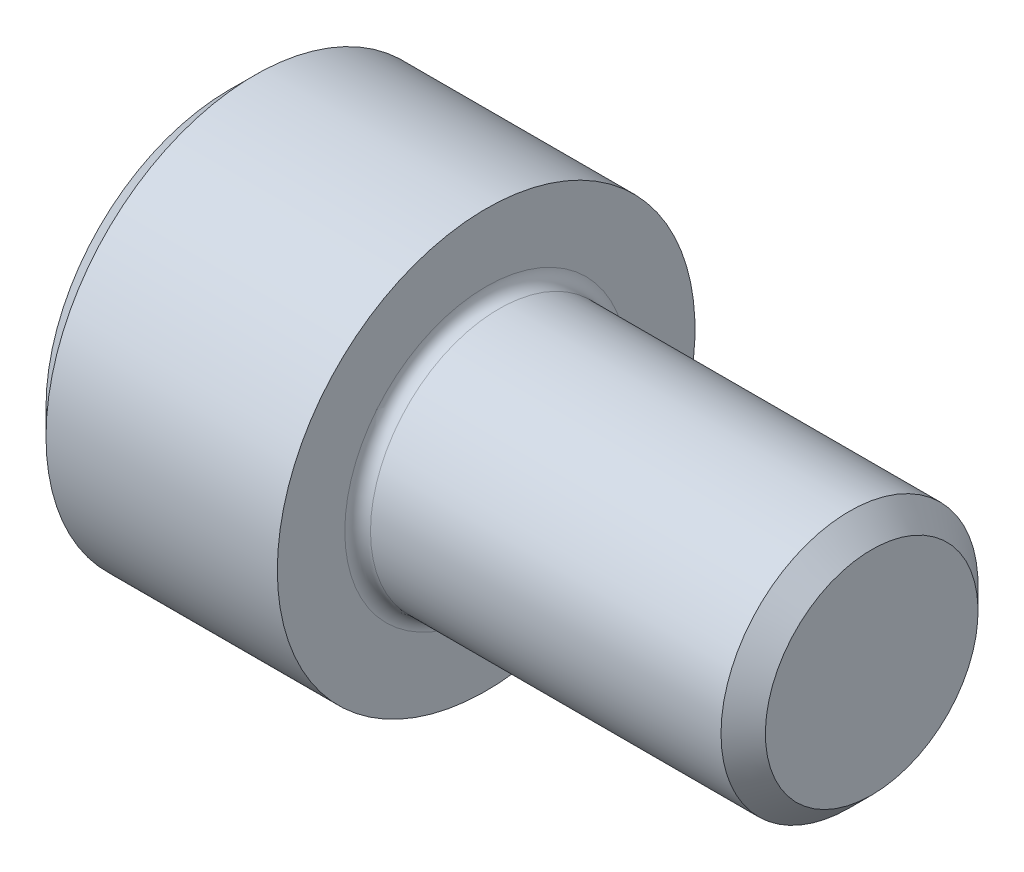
ISO-10303-21;
HEADER;
FILE_DESCRIPTION(('STEP AP214'),'2;1');
FILE_NAME('part.step','',(''),(''),'','','');
FILE_SCHEMA(('AUTOMOTIVE_DESIGN { 1 0 10303 214 1 1 1 1 }'));
ENDSEC;
DATA;
#1=APPLICATION_CONTEXT('core data for automotive mechanical design processes');
#2=APPLICATION_PROTOCOL_DEFINITION('international standard','automotive_design',2000,#1);
#3=PRODUCT_CONTEXT('',#1,'mechanical');
#4=PRODUCT('Part','Part','',(#3));
#5=PRODUCT_RELATED_PRODUCT_CATEGORY('part','',(#4));
#6=PRODUCT_DEFINITION_FORMATION('','',#4);
#7=PRODUCT_DEFINITION_CONTEXT('part definition',#1,'design');
#8=PRODUCT_DEFINITION('design','',#6,#7);
#9=PRODUCT_DEFINITION_SHAPE('','',#8);
#10=(LENGTH_UNIT() NAMED_UNIT(*) SI_UNIT(.MILLI.,.METRE.));
#11=(NAMED_UNIT(*) PLANE_ANGLE_UNIT() SI_UNIT($,.RADIAN.));
#12=(NAMED_UNIT(*) SI_UNIT($,.STERADIAN.) SOLID_ANGLE_UNIT());
#13=UNCERTAINTY_MEASURE_WITH_UNIT(LENGTH_MEASURE(1.E-05),#10,'distance_accuracy_value','');
#14=(GEOMETRIC_REPRESENTATION_CONTEXT(3) GLOBAL_UNCERTAINTY_ASSIGNED_CONTEXT((#13)) GLOBAL_UNIT_ASSIGNED_CONTEXT((#10,
#11,#12)) REPRESENTATION_CONTEXT('',''));
#15=CARTESIAN_POINT('',(0.,0.,0.));
#16=DIRECTION('',(0.,0.,1.));
#17=DIRECTION('',(1.,0.,0.));
#18=AXIS2_PLACEMENT_3D('',#15,#16,#17);
#19=CARTESIAN_POINT('',(20.,-3.349214,3.349214));
#20=DIRECTION('',(1.,0.,0.));
#21=DIRECTION('',(0.,0.,-1.));
#22=AXIS2_PLACEMENT_3D('',#19,#20,#21);
#23=PLANE('',#22);
#24=CARTESIAN_POINT('',(20.,0.,0.));
#25=DIRECTION('',(-1.,0.,0.));
#26=DIRECTION('',(0.,-1.,0.));
#27=AXIS2_PLACEMENT_3D('',#24,#25,#26);
#28=CIRCLE('',#27,3.30949999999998);
#29=CARTESIAN_POINT('',(20.,-3.30949999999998,0.));
#30=VERTEX_POINT('',#29);
#31=EDGE_CURVE('E20',#30,#30,#28,.F.);
#32=ORIENTED_EDGE('',*,*,#31,.T.);
#33=EDGE_LOOP('',(#32));
#34=FACE_BOUND('',#33,.T.);
#35=ADVANCED_FACE('F16',(#34),#23,.T.);
#36=CARTESIAN_POINT('',(20.,0.,0.));
#37=DIRECTION('',(-1.,0.,0.));
#38=DIRECTION('',(0.,-1.,0.));
#39=AXIS2_PLACEMENT_3D('',#36,#37,#38);
#40=CONICAL_SURFACE('',#39,3.3095,0.785398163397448);
#41=CARTESIAN_POINT('',(19.3095,0.,0.));
#42=DIRECTION('',(-1.,0.,0.));
#43=DIRECTION('',(0.,0.,1.));
#44=AXIS2_PLACEMENT_3D('',#41,#42,#43);
#45=CIRCLE('',#44,4.);
#46=CARTESIAN_POINT('',(19.3095,0.,4.));
#47=VERTEX_POINT('',#46);
#48=EDGE_CURVE('E124',#47,#47,#45,.F.);
#49=ORIENTED_EDGE('',*,*,#48,.T.);
#50=EDGE_LOOP('',(#49));
#51=FACE_BOUND('',#50,.T.);
#52=ORIENTED_EDGE('',*,*,#31,.F.);
#53=EDGE_LOOP('',(#52));
#54=FACE_BOUND('',#53,.T.);
#55=ADVANCED_FACE('F254',(#51,#54),#40,.T.);
#56=CARTESIAN_POINT('',(19.3095,0.,0.));
#57=DIRECTION('',(-1.,0.,0.));
#58=DIRECTION('',(0.,0.,1.));
#59=AXIS2_PLACEMENT_3D('',#56,#57,#58);
#60=CYLINDRICAL_SURFACE('',#59,4.);
#61=CARTESIAN_POINT('',(8.40000000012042,0.,0.));
#62=DIRECTION('',(1.,0.,0.));
#63=DIRECTION('',(0.,0.,-1.));
#64=AXIS2_PLACEMENT_3D('',#61,#62,#63);
#65=CIRCLE('',#64,4.00000000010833);
#66=CARTESIAN_POINT('',(8.40000000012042,0.,-4.00000000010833));
#67=VERTEX_POINT('',#66);
#68=EDGE_CURVE('E120',#67,#67,#65,.T.);
#69=ORIENTED_EDGE('',*,*,#68,.T.);
#70=EDGE_LOOP('',(#69));
#71=FACE_BOUND('',#70,.T.);
#72=ORIENTED_EDGE('',*,*,#48,.F.);
#73=EDGE_LOOP('',(#72));
#74=FACE_BOUND('',#73,.T.);
#75=ADVANCED_FACE('F250',(#71,#74),#60,.T.);
#76=CARTESIAN_POINT('',(8.40000000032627,0.,0.));
#77=DIRECTION('',(1.,0.,0.));
#78=DIRECTION('',(0.,0.,-1.));
#79=AXIS2_PLACEMENT_3D('',#76,#77,#78);
#80=TOROIDAL_SURFACE('',#79,4.40000000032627,0.400000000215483);
#81=ORIENTED_EDGE('',*,*,#68,.F.);
#82=EDGE_LOOP('',(#81));
#83=FACE_BOUND('',#82,.T.);
#84=CARTESIAN_POINT('',(8.00000000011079,0.,0.));
#85=DIRECTION('',(1.,0.,0.));
#86=DIRECTION('',(0.,0.,-1.));
#87=AXIS2_PLACEMENT_3D('',#84,#85,#86);
#88=CIRCLE('',#87,4.400000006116);
#89=CARTESIAN_POINT('',(8.00000000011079,0.,-4.400000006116));
#90=VERTEX_POINT('',#89);
#91=EDGE_CURVE('E118',#90,#90,#88,.F.);
#92=ORIENTED_EDGE('',*,*,#91,.F.);
#93=EDGE_LOOP('',(#92));
#94=FACE_BOUND('',#93,.T.);
#95=ADVANCED_FACE('F253',(#83,#94),#80,.F.);
#96=CARTESIAN_POINT('',(8.,-6.578,6.578));
#97=DIRECTION('',(1.,0.,0.));
#98=DIRECTION('',(0.,0.,-1.));
#99=AXIS2_PLACEMENT_3D('',#96,#97,#98);
#100=PLANE('',#99);
#101=ORIENTED_EDGE('',*,*,#91,.T.);
#102=EDGE_LOOP('',(#101));
#103=FACE_BOUND('',#102,.T.);
#104=CARTESIAN_POINT('',(8.,0.,0.));
#105=DIRECTION('',(-1.,0.,0.));
#106=DIRECTION('',(0.,0.,1.));
#107=AXIS2_PLACEMENT_3D('',#104,#105,#106);
#108=CIRCLE('',#107,6.5);
#109=CARTESIAN_POINT('',(8.,0.,6.5));
#110=VERTEX_POINT('',#109);
#111=EDGE_CURVE('E116',#110,#110,#108,.F.);
#112=ORIENTED_EDGE('',*,*,#111,.T.);
#113=EDGE_LOOP('',(#112));
#114=FACE_BOUND('',#113,.T.);
#115=ADVANCED_FACE('F248',(#103,#114),#100,.T.);
#116=CARTESIAN_POINT('',(8.,0.,0.));
#117=DIRECTION('',(-1.,0.,0.));
#118=DIRECTION('',(0.,0.,1.));
#119=AXIS2_PLACEMENT_3D('',#116,#117,#118);
#120=CYLINDRICAL_SURFACE('',#119,6.5);
#121=CARTESIAN_POINT('',(0.799999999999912,0.,0.));
#122=DIRECTION('',(1.,0.,0.));
#123=DIRECTION('',(0.,0.,-1.));
#124=AXIS2_PLACEMENT_3D('',#121,#122,#123);
#125=CIRCLE('',#124,6.5);
#126=CARTESIAN_POINT('',(0.8,0.,-6.5));
#127=VERTEX_POINT('',#126);
#128=EDGE_CURVE('E93',#127,#127,#125,.T.);
#129=ORIENTED_EDGE('',*,*,#128,.T.);
#130=EDGE_LOOP('',(#129));
#131=FACE_BOUND('',#130,.T.);
#132=ORIENTED_EDGE('',*,*,#111,.F.);
#133=EDGE_LOOP('',(#132));
#134=FACE_BOUND('',#133,.T.);
#135=ADVANCED_FACE('F244',(#131,#134),#120,.T.);
#136=CARTESIAN_POINT('',(0.,0.,0.));
#137=DIRECTION('',(1.,0.,0.));
#138=DIRECTION('',(0.,0.,-1.));
#139=AXIS2_PLACEMENT_3D('',#136,#137,#138);
#140=CONICAL_SURFACE('',#139,5.7,0.785398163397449);
#141=ORIENTED_EDGE('',*,*,#128,.F.);
#142=EDGE_LOOP('',(#141));
#143=FACE_BOUND('',#142,.T.);
#144=CARTESIAN_POINT('',(0.,0.,0.));
#145=DIRECTION('',(1.,0.,0.));
#146=DIRECTION('',(0.,0.,-1.));
#147=AXIS2_PLACEMENT_3D('',#144,#145,#146);
#148=CIRCLE('',#147,5.7);
#149=CARTESIAN_POINT('',(0.,0.,-5.7));
#150=VERTEX_POINT('',#149);
#151=EDGE_CURVE('E92',#150,#150,#148,.F.);
#152=ORIENTED_EDGE('',*,*,#151,.F.);
#153=EDGE_LOOP('',(#152));
#154=FACE_BOUND('',#153,.T.);
#155=ADVANCED_FACE('F241',(#143,#154),#140,.T.);
#156=CARTESIAN_POINT('',(0.,1.759474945,-3.0475));
#157=DIRECTION('',(0.,0.866025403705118,-0.500000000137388));
#158=DIRECTION('',(0.,0.500000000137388,0.866025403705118));
#159=AXIS2_PLACEMENT_3D('',#156,#157,#158);
#160=PLANE('',#159);
#161=DIRECTION('',(1.,0.,0.));
#162=VECTOR('',#161,1.);
#163=CARTESIAN_POINT('',(2.,1.759474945,-3.0475));
#164=LINE('',#163,#162);
#165=CARTESIAN_POINT('',(0.,1.75947494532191,-3.0475));
#166=VERTEX_POINT('',#165);
#167=CARTESIAN_POINT('',(4.,1.759474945,-3.0475));
#168=VERTEX_POINT('',#167);
#169=EDGE_CURVE('E159',#166,#168,#164,.T.);
#170=ORIENTED_EDGE('',*,*,#169,.T.);
#171=DIRECTION('',(0.,0.500000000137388,0.866025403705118));
#172=VECTOR('',#171,1.);
#173=CARTESIAN_POINT('',(4.,1.759474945,-3.0475));
#174=LINE('',#173,#172);
#175=CARTESIAN_POINT('',(4.,2.63921241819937,-1.52374999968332));
#176=VERTEX_POINT('',#175);
#177=EDGE_CURVE('E157',#168,#176,#174,.T.);
#178=ORIENTED_EDGE('',*,*,#177,.T.);
#179=DIRECTION('',(0.,0.500000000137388,0.866025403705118));
#180=VECTOR('',#179,1.);
#181=CARTESIAN_POINT('',(4.,1.759474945,-3.0475));
#182=LINE('',#181,#180);
#183=CARTESIAN_POINT('',(4.,3.518949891,0.));
#184=VERTEX_POINT('',#183);
#185=EDGE_CURVE('E87',#176,#184,#182,.T.);
#186=ORIENTED_EDGE('',*,*,#185,.T.);
#187=DIRECTION('',(1.,0.,0.));
#188=VECTOR('',#187,1.);
#189=CARTESIAN_POINT('',(2.,3.518949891,0.));
#190=LINE('',#189,#188);
#191=CARTESIAN_POINT('',(0.,3.5189498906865,-4.93629063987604E-11));
#192=VERTEX_POINT('',#191);
#193=EDGE_CURVE('E80',#192,#184,#190,.T.);
#194=ORIENTED_EDGE('',*,*,#193,.F.);
#195=DIRECTION('',(0.,0.499999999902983,0.866025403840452));
#196=VECTOR('',#195,1.);
#197=CARTESIAN_POINT('',(0.,1.759474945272,-3.047500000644));
#198=LINE('',#197,#196);
#199=EDGE_CURVE('E84',#166,#192,#198,.T.);
#200=ORIENTED_EDGE('',*,*,#199,.F.);
#201=EDGE_LOOP('',(#170,#178,#186,#194,#200));
#202=FACE_BOUND('',#201,.T.);
#203=ADVANCED_FACE('F83',(#202),#160,.F.);
#204=CARTESIAN_POINT('',(0.,1.759474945,3.0475));
#205=DIRECTION('',(0.,-0.866025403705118,-0.500000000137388));
#206=DIRECTION('',(0.,0.500000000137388,-0.866025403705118));
#207=AXIS2_PLACEMENT_3D('',#204,#205,#206);
#208=PLANE('',#207);
#209=DIRECTION('',(0.,0.500000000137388,-0.866025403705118));
#210=VECTOR('',#209,1.);
#211=CARTESIAN_POINT('',(4.,1.759474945,3.0475));
#212=LINE('',#211,#210);
#213=CARTESIAN_POINT('',(4.,2.63921241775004,1.52375000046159));
#214=VERTEX_POINT('',#213);
#215=CARTESIAN_POINT('',(4.,1.759474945,3.0475));
#216=VERTEX_POINT('',#215);
#217=EDGE_CURVE('E105',#214,#216,#212,.F.);
#218=ORIENTED_EDGE('',*,*,#217,.T.);
#219=DIRECTION('',(-1.,0.,0.));
#220=VECTOR('',#219,1.);
#221=CARTESIAN_POINT('',(2.,1.759474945,3.0475));
#222=LINE('',#221,#220);
#223=CARTESIAN_POINT('',(0.,1.75947494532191,3.0475));
#224=VERTEX_POINT('',#223);
#225=EDGE_CURVE('E110',#216,#224,#222,.T.);
#226=ORIENTED_EDGE('',*,*,#225,.T.);
#227=DIRECTION('',(0.,-0.499999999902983,0.866025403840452));
#228=VECTOR('',#227,1.);
#229=CARTESIAN_POINT('',(0.,3.518949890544,0.));
#230=LINE('',#229,#228);
#231=EDGE_CURVE('E100',#192,#224,#230,.T.);
#232=ORIENTED_EDGE('',*,*,#231,.F.);
#233=ORIENTED_EDGE('',*,*,#193,.T.);
#234=DIRECTION('',(0.,0.500000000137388,-0.866025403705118));
#235=VECTOR('',#234,1.);
#236=CARTESIAN_POINT('',(4.,1.759474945,3.0475));
#237=LINE('',#236,#235);
#238=EDGE_CURVE('E160',#184,#214,#237,.F.);
#239=ORIENTED_EDGE('',*,*,#238,.T.);
#240=EDGE_LOOP('',(#218,#226,#232,#233,#239));
#241=FACE_BOUND('',#240,.T.);
#242=ADVANCED_FACE('F108',(#241),#208,.T.);
#243=CARTESIAN_POINT('',(0.,-5.7684,-5.7684));
#244=DIRECTION('',(-1.,0.,0.));
#245=DIRECTION('',(0.,0.,1.));
#246=AXIS2_PLACEMENT_3D('',#243,#244,#245);
#247=PLANE('',#246);
#248=DIRECTION('',(0.,1.,0.));
#249=VECTOR('',#248,1.);
#250=CARTESIAN_POINT('',(0.,0.,-3.0475));
#251=LINE('',#250,#249);
#252=CARTESIAN_POINT('',(0.,-1.759474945,-3.0475));
#253=VERTEX_POINT('',#252);
#254=EDGE_CURVE('E104',#253,#166,#251,.T.);
#255=ORIENTED_EDGE('',*,*,#254,.T.);
#256=ORIENTED_EDGE('',*,*,#199,.T.);
#257=ORIENTED_EDGE('',*,*,#231,.T.);
#258=DIRECTION('',(0.,-1.,0.));
#259=VECTOR('',#258,1.);
#260=CARTESIAN_POINT('',(0.,0.,3.0475));
#261=LINE('',#260,#259);
#262=CARTESIAN_POINT('',(0.,-1.759474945,3.0475));
#263=VERTEX_POINT('',#262);
#264=EDGE_CURVE('E172',#224,#263,#261,.T.);
#265=ORIENTED_EDGE('',*,*,#264,.T.);
#266=DIRECTION('',(0.,0.500000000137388,0.866025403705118));
#267=VECTOR('',#266,1.);
#268=CARTESIAN_POINT('',(0.,-2.639212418,1.52375));
#269=LINE('',#268,#267);
#270=CARTESIAN_POINT('',(0.,-3.518949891,0.));
#271=VERTEX_POINT('',#270);
#272=EDGE_CURVE('E198',#271,#263,#269,.T.);
#273=ORIENTED_EDGE('',*,*,#272,.F.);
#274=DIRECTION('',(0.,-0.500000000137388,0.866025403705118));
#275=VECTOR('',#274,1.);
#276=CARTESIAN_POINT('',(0.,-2.639212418,-1.52375));
#277=LINE('',#276,#275);
#278=EDGE_CURVE('E178',#253,#271,#277,.T.);
#279=ORIENTED_EDGE('',*,*,#278,.F.);
#280=EDGE_LOOP('',(#255,#256,#257,#265,#273,#279));
#281=FACE_BOUND('',#280,.T.);
#282=ORIENTED_EDGE('',*,*,#151,.T.);
#283=EDGE_LOOP('',(#282));
#284=FACE_BOUND('',#283,.T.);
#285=ADVANCED_FACE('F97',(#281,#284),#247,.T.);
#286=CARTESIAN_POINT('',(4.,-0.015835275,3.0475));
#287=DIRECTION('',(1.,0.,0.));
#288=DIRECTION('',(0.,0.,-1.));
#289=AXIS2_PLACEMENT_3D('',#286,#287,#288);
#290=PLANE('',#289);
#291=ORIENTED_EDGE('',*,*,#217,.F.);
#292=CARTESIAN_POINT('',(4.,0.,0.));
#293=DIRECTION('',(-1.,0.,0.));
#294=DIRECTION('',(0.,0.,1.));
#295=AXIS2_PLACEMENT_3D('',#292,#293,#294);
#296=CIRCLE('',#295,3.0475);
#297=CARTESIAN_POINT('',(4.,-2.73646157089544E-10,3.0475));
#298=VERTEX_POINT('',#297);
#299=EDGE_CURVE('E153',#298,#214,#296,.T.);
#300=ORIENTED_EDGE('',*,*,#299,.F.);
#301=DIRECTION('',(0.,1.,0.));
#302=VECTOR('',#301,1.);
#303=CARTESIAN_POINT('',(4.,0.,3.0475));
#304=LINE('',#303,#302);
#305=EDGE_CURVE('E169',#298,#216,#304,.T.);
#306=ORIENTED_EDGE('',*,*,#305,.T.);
#307=EDGE_LOOP('',(#291,#300,#306));
#308=FACE_BOUND('',#307,.T.);
#309=ADVANCED_FACE('F174',(#308),#290,.F.);
#310=CARTESIAN_POINT('',(4.,2.633933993,1.542035));
#311=DIRECTION('',(1.,0.,0.));
#312=DIRECTION('',(0.,0.,-1.));
#313=AXIS2_PLACEMENT_3D('',#310,#311,#312);
#314=PLANE('',#313);
#315=ORIENTED_EDGE('',*,*,#185,.F.);
#316=CARTESIAN_POINT('',(4.,0.,0.));
#317=DIRECTION('',(-1.,0.,0.));
#318=DIRECTION('',(0.,0.,1.));
#319=AXIS2_PLACEMENT_3D('',#316,#317,#318);
#320=CIRCLE('',#319,3.0475);
#321=EDGE_CURVE('E150',#214,#176,#320,.T.);
#322=ORIENTED_EDGE('',*,*,#321,.F.);
#323=ORIENTED_EDGE('',*,*,#238,.F.);
#324=EDGE_LOOP('',(#315,#322,#323));
#325=FACE_BOUND('',#324,.T.);
#326=ADVANCED_FACE('F221',(#325),#314,.F.);
#327=CARTESIAN_POINT('',(4.,-0.015835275,-1.5146075));
#328=DIRECTION('',(1.,0.,0.));
#329=DIRECTION('',(0.,0.,-1.));
#330=AXIS2_PLACEMENT_3D('',#327,#328,#329);
#331=PLANE('',#330);
#332=DIRECTION('',(0.,-1.,0.));
#333=VECTOR('',#332,1.);
#334=CARTESIAN_POINT('',(4.,0.,-3.0475));
#335=LINE('',#334,#333);
#336=CARTESIAN_POINT('',(4.,-6.2505282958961E-10,-3.0475));
#337=VERTEX_POINT('',#336);
#338=EDGE_CURVE('E189',#168,#337,#335,.T.);
#339=ORIENTED_EDGE('',*,*,#338,.T.);
#340=CARTESIAN_POINT('',(4.,0.,0.));
#341=DIRECTION('',(-1.,0.,0.));
#342=DIRECTION('',(0.,0.,1.));
#343=AXIS2_PLACEMENT_3D('',#340,#341,#342);
#344=CIRCLE('',#343,3.0475);
#345=EDGE_CURVE('E148',#176,#337,#344,.T.);
#346=ORIENTED_EDGE('',*,*,#345,.F.);
#347=ORIENTED_EDGE('',*,*,#177,.F.);
#348=EDGE_LOOP('',(#339,#346,#347));
#349=FACE_BOUND('',#348,.T.);
#350=ADVANCED_FACE('F217',(#349),#331,.F.);
#351=CARTESIAN_POINT('',(0.,-1.759474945,-3.0475));
#352=DIRECTION('',(0.,0.,-1.));
#353=DIRECTION('',(0.,1.,0.));
#354=AXIS2_PLACEMENT_3D('',#351,#352,#353);
#355=PLANE('',#354);
#356=DIRECTION('',(-1.,0.,0.));
#357=VECTOR('',#356,1.);
#358=CARTESIAN_POINT('',(2.,-1.759474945,-3.0475));
#359=LINE('',#358,#357);
#360=CARTESIAN_POINT('',(4.,-1.759474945,-3.0475));
#361=VERTEX_POINT('',#360);
#362=EDGE_CURVE('E175',#361,#253,#359,.T.);
#363=ORIENTED_EDGE('',*,*,#362,.F.);
#364=DIRECTION('',(0.,1.,0.));
#365=VECTOR('',#364,1.);
#366=CARTESIAN_POINT('',(4.,-1.319606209,-3.0475));
#367=LINE('',#366,#365);
#368=EDGE_CURVE('E144',#361,#337,#367,.T.);
#369=ORIENTED_EDGE('',*,*,#368,.T.);
#370=ORIENTED_EDGE('',*,*,#338,.F.);
#371=ORIENTED_EDGE('',*,*,#169,.F.);
#372=ORIENTED_EDGE('',*,*,#254,.F.);
#373=EDGE_LOOP('',(#363,#369,#370,#371,#372));
#374=FACE_BOUND('',#373,.T.);
#375=ADVANCED_FACE('F212',(#374),#355,.F.);
#376=CARTESIAN_POINT('',(0.,-1.759474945,-3.0475));
#377=DIRECTION('',(0.,0.866025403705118,0.500000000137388));
#378=DIRECTION('',(0.,-0.500000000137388,0.866025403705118));
#379=AXIS2_PLACEMENT_3D('',#376,#377,#378);
#380=PLANE('',#379);
#381=DIRECTION('',(0.,-0.500000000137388,0.866025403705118));
#382=VECTOR('',#381,1.);
#383=CARTESIAN_POINT('',(4.,-1.759474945,-3.0475));
#384=LINE('',#383,#382);
#385=CARTESIAN_POINT('',(4.,-2.63921241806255,-1.5237499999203));
#386=VERTEX_POINT('',#385);
#387=EDGE_CURVE('E145',#386,#361,#384,.F.);
#388=ORIENTED_EDGE('',*,*,#387,.T.);
#389=ORIENTED_EDGE('',*,*,#362,.T.);
#390=ORIENTED_EDGE('',*,*,#278,.T.);
#391=DIRECTION('',(-1.,0.,0.));
#392=VECTOR('',#391,1.);
#393=CARTESIAN_POINT('',(2.,-3.518949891,0.));
#394=LINE('',#393,#392);
#395=CARTESIAN_POINT('',(4.,-3.518949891,0.));
#396=VERTEX_POINT('',#395);
#397=EDGE_CURVE('E156',#396,#271,#394,.T.);
#398=ORIENTED_EDGE('',*,*,#397,.F.);
#399=DIRECTION('',(0.,-0.500000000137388,0.866025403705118));
#400=VECTOR('',#399,1.);
#401=CARTESIAN_POINT('',(4.,-1.759474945,-3.0475));
#402=LINE('',#401,#400);
#403=EDGE_CURVE('E140',#396,#386,#402,.F.);
#404=ORIENTED_EDGE('',*,*,#403,.T.);
#405=EDGE_LOOP('',(#388,#389,#390,#398,#404));
#406=FACE_BOUND('',#405,.T.);
#407=ADVANCED_FACE('F297',(#406),#380,.T.);
#408=CARTESIAN_POINT('',(0.,1.759474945,3.0475));
#409=DIRECTION('',(0.,0.,1.));
#410=DIRECTION('',(0.,-1.,0.));
#411=AXIS2_PLACEMENT_3D('',#408,#409,#410);
#412=PLANE('',#411);
#413=ORIENTED_EDGE('',*,*,#225,.F.);
#414=ORIENTED_EDGE('',*,*,#305,.F.);
#415=DIRECTION('',(0.,-1.,0.));
#416=VECTOR('',#415,1.);
#417=CARTESIAN_POINT('',(4.,-1.319606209,3.0475));
#418=LINE('',#417,#416);
#419=CARTESIAN_POINT('',(4.,-1.759474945,3.0475));
#420=VERTEX_POINT('',#419);
#421=EDGE_CURVE('E139',#298,#420,#418,.T.);
#422=ORIENTED_EDGE('',*,*,#421,.T.);
#423=DIRECTION('',(1.,0.,0.));
#424=VECTOR('',#423,1.);
#425=CARTESIAN_POINT('',(2.,-1.759474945,3.0475));
#426=LINE('',#425,#424);
#427=EDGE_CURVE('E186',#263,#420,#426,.T.);
#428=ORIENTED_EDGE('',*,*,#427,.F.);
#429=ORIENTED_EDGE('',*,*,#264,.F.);
#430=EDGE_LOOP('',(#413,#414,#422,#428,#429));
#431=FACE_BOUND('',#430,.T.);
#432=ADVANCED_FACE('F167',(#431),#412,.F.);
#433=CARTESIAN_POINT('',(0.,-3.518949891,0.));
#434=DIRECTION('',(0.,0.866025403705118,-0.500000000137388));
#435=DIRECTION('',(0.,0.500000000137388,0.866025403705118));
#436=AXIS2_PLACEMENT_3D('',#433,#434,#435);
#437=PLANE('',#436);
#438=DIRECTION('',(0.,0.500000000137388,0.866025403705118));
#439=VECTOR('',#438,1.);
#440=CARTESIAN_POINT('',(4.,-3.518949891,0.));
#441=LINE('',#440,#439);
#442=CARTESIAN_POINT('',(4.,-2.63921241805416,1.52374999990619));
#443=VERTEX_POINT('',#442);
#444=EDGE_CURVE('E35',#443,#396,#441,.F.);
#445=ORIENTED_EDGE('',*,*,#444,.T.);
#446=ORIENTED_EDGE('',*,*,#397,.T.);
#447=ORIENTED_EDGE('',*,*,#272,.T.);
#448=ORIENTED_EDGE('',*,*,#427,.T.);
#449=DIRECTION('',(0.,0.500000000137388,0.866025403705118));
#450=VECTOR('',#449,1.);
#451=CARTESIAN_POINT('',(4.,-3.518949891,0.));
#452=LINE('',#451,#450);
#453=EDGE_CURVE('E136',#420,#443,#452,.F.);
#454=ORIENTED_EDGE('',*,*,#453,.T.);
#455=EDGE_LOOP('',(#445,#446,#447,#448,#454));
#456=FACE_BOUND('',#455,.T.);
#457=ADVANCED_FACE('F311',(#456),#437,.T.);
#458=CARTESIAN_POINT('',(4.,-2.655047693,-1.5146075));
#459=DIRECTION('',(1.,0.,0.));
#460=DIRECTION('',(0.,0.,-1.));
#461=AXIS2_PLACEMENT_3D('',#458,#459,#460);
#462=PLANE('',#461);
#463=ORIENTED_EDGE('',*,*,#387,.F.);
#464=CARTESIAN_POINT('',(4.,0.,0.));
#465=DIRECTION('',(-1.,0.,0.));
#466=DIRECTION('',(0.,0.,1.));
#467=AXIS2_PLACEMENT_3D('',#464,#465,#466);
#468=CIRCLE('',#467,3.0475);
#469=EDGE_CURVE('E133',#337,#386,#468,.T.);
#470=ORIENTED_EDGE('',*,*,#469,.F.);
#471=ORIENTED_EDGE('',*,*,#368,.F.);
#472=EDGE_LOOP('',(#463,#470,#471));
#473=FACE_BOUND('',#472,.T.);
#474=ADVANCED_FACE('F318',(#473),#462,.F.);
#475=CARTESIAN_POINT('',(4.,-3.524228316,1.542035));
#476=DIRECTION('',(1.,0.,0.));
#477=DIRECTION('',(0.,0.,-1.));
#478=AXIS2_PLACEMENT_3D('',#475,#476,#477);
#479=PLANE('',#478);
#480=ORIENTED_EDGE('',*,*,#444,.F.);
#481=CARTESIAN_POINT('',(4.,0.,0.));
#482=DIRECTION('',(-1.,0.,0.));
#483=DIRECTION('',(0.,0.,1.));
#484=AXIS2_PLACEMENT_3D('',#481,#482,#483);
#485=CIRCLE('',#484,3.0475);
#486=EDGE_CURVE('E26',#386,#443,#485,.T.);
#487=ORIENTED_EDGE('',*,*,#486,.F.);
#488=ORIENTED_EDGE('',*,*,#403,.F.);
#489=EDGE_LOOP('',(#480,#487,#488));
#490=FACE_BOUND('',#489,.T.);
#491=ADVANCED_FACE('F237',(#490),#479,.F.);
#492=CARTESIAN_POINT('',(4.,-2.655047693,3.0475));
#493=DIRECTION('',(1.,0.,0.));
#494=DIRECTION('',(0.,0.,-1.));
#495=AXIS2_PLACEMENT_3D('',#492,#493,#494);
#496=PLANE('',#495);
#497=ORIENTED_EDGE('',*,*,#421,.F.);
#498=CARTESIAN_POINT('',(4.,0.,0.));
#499=DIRECTION('',(-1.,0.,0.));
#500=DIRECTION('',(0.,0.,1.));
#501=AXIS2_PLACEMENT_3D('',#498,#499,#500);
#502=CIRCLE('',#501,3.0475);
#503=EDGE_CURVE('E10',#443,#298,#502,.T.);
#504=ORIENTED_EDGE('',*,*,#503,.F.);
#505=ORIENTED_EDGE('',*,*,#453,.F.);
#506=EDGE_LOOP('',(#497,#504,#505));
#507=FACE_BOUND('',#506,.T.);
#508=ADVANCED_FACE('F18',(#507),#496,.F.);
#509=CARTESIAN_POINT('',(5.759474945,0.,0.));
#510=DIRECTION('',(-1.,0.,0.));
#511=DIRECTION('',(0.,0.,1.));
#512=AXIS2_PLACEMENT_3D('',#509,#510,#511);
#513=CONICAL_SURFACE('',#512,0.,1.04719755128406);
#514=CARTESIAN_POINT('',(5.759474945,0.,0.));
#515=VERTEX_POINT('',#514);
#516=VERTEX_LOOP('',#515);
#517=FACE_BOUND('',#516,.T.);
#518=ORIENTED_EDGE('',*,*,#486,.T.);
#519=ORIENTED_EDGE('',*,*,#503,.T.);
#520=ORIENTED_EDGE('',*,*,#299,.T.);
#521=ORIENTED_EDGE('',*,*,#321,.T.);
#522=ORIENTED_EDGE('',*,*,#345,.T.);
#523=ORIENTED_EDGE('',*,*,#469,.T.);
#524=EDGE_LOOP('',(#518,#519,#520,#521,#522,#523));
#525=FACE_BOUND('',#524,.T.);
#526=ADVANCED_FACE('F219',(#517,#525),#513,.F.);
#527=CLOSED_SHELL('',(#35,#55,#75,#95,#115,#135,#155,#203,#242,#285,#309,#326,#350,#375,#407,
#432,#457,#474,#491,#508,#526));
#528=MANIFOLD_SOLID_BREP('B1',#527);
#529=ADVANCED_BREP_SHAPE_REPRESENTATION('',(#18,#528),#14);
#530=SHAPE_DEFINITION_REPRESENTATION(#9,#529);
ENDSEC;
END-ISO-10303-21;
